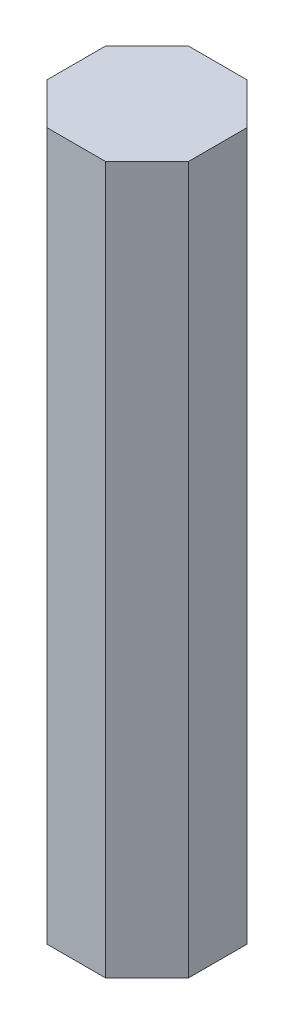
from build123d import *

# Parameters (mm, degrees)
FORME_EXT_RIEURE_DEPTH = 1000


with BuildPart() as part:
    # Esquisse1 → Forme ext_rieure (new body)
    with BuildSketch(Plane(origin=(0, 0, 0), x_dir=(1, 0, 0), z_dir=(0, 1, 0))):
        Polygon((41.421356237, -100), (100, -41.421356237), (100, 41.421356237), (41.421356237, 100), (-41.421356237, 100), (-100, 41.421356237), (-100, -41.421356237), (-41.421356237, -100), align=None)
    extrude(amount=FORME_EXT_RIEURE_DEPTH)


solid = part.part
